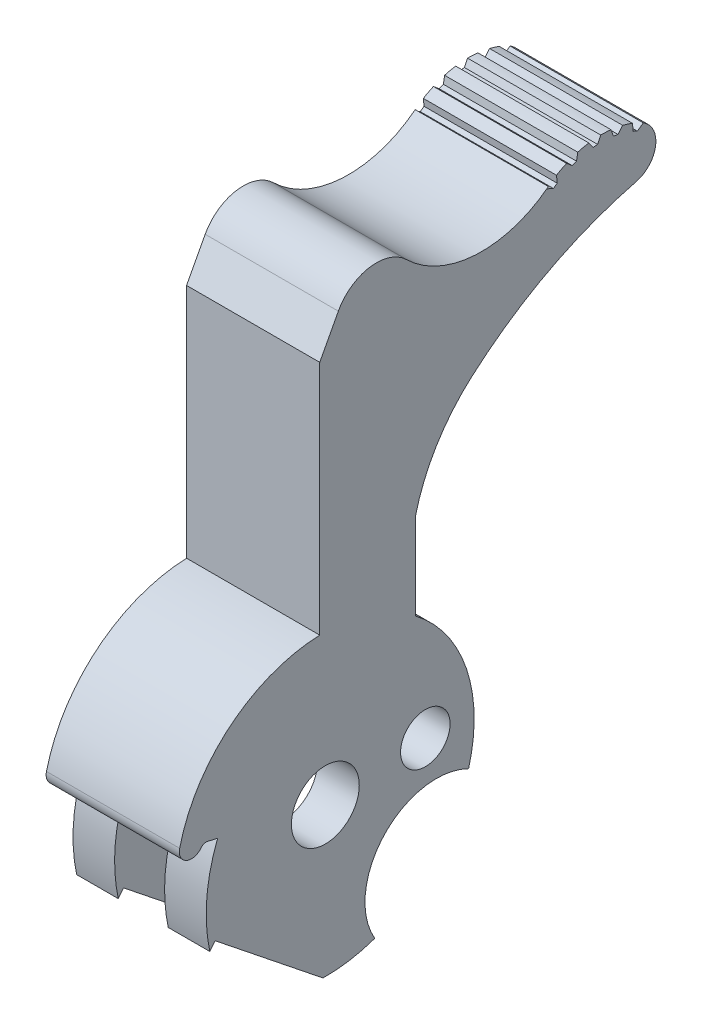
from build123d import *

# Parameters (mm, degrees)
BOSS_EXTRUDE1_DEPTH = 3.9243
SKETCH1_3_R         = 2.00025
SKETCH1_3_R_2       = 1.460154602
CUT_EXTRUDE1_DEPTH  = 3.9243
CUT_EXTRUDE2_START  = -7.8486
CUT_EXTRUDE2_DEPTH  = 7.8486
CUT_EXTRUDE3_DEPTH  = 1.4732


with BuildPart() as part:
    # Sketch1 → Boss-Extrude1 (new, symmetric)
    with BuildSketch(Plane(origin=(0, 0, 0), x_dir=(0, 0, -1), z_dir=(1, 0, 0))):
        with BuildLine():
            Line((-0.3302, 8.826968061), (-0.3302, 22.75164579))
            Line((-0.3302, 22.75164579), (0.766616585, 24.814457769))
            ThreePointArc((0.766616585, 24.814457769), (2.619321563, 26.131883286), (4.784425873, 25.438738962))
            ThreePointArc((4.784425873, 25.438738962), (8.879896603, 23.639820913), (13.145242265, 24.987341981))
            ThreePointArc((13.145242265, 24.987341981), (15.837831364, 26.053146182), (18.675292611, 25.474537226))
            ThreePointArc((18.675292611, 25.474537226), (19.47064603, 23.945954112), (18.331995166, 22.652653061))
            ThreePointArc((18.331995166, 22.652653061), (13.166970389, 20.668693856), (8.613175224, 17.526))
            ThreePointArc((8.613175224, 17.526), (6.543107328, 15.049229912), (5.3086, 12.066686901))
            Line((5.3086, 12.066686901), (5.3086, 6.983313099))
            ThreePointArc((5.3086, 6.983313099), (8.317960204, 2.785576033), (8.443547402, -2.377898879))
            ThreePointArc((8.443547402, -2.377898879), (3.477922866, -3.262237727), (2.912868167, -8.274242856))
            ThreePointArc((2.912868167, -8.274242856), (1.409383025, -8.658032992), (-0.138202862, -8.770906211))
            Line((-0.138202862, -8.770906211), (-6.494134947, -3.692419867))
            Line((-6.494134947, -3.692419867), (-6.807391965, -4.084473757))
            ThreePointArc((-6.807391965, -4.084473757), (-6.990019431, -1.275331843), (-6.347900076, 1.465528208))
            Line((-6.347900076, 1.465528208), (-6.93746292, 1.601639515))
            ThreePointArc((-6.93746292, 1.601639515), (-7.150845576, 1.589374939), (-7.324048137, 1.464141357))
            ThreePointArc((-7.324048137, 1.464141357), (-8.200857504, 1.258047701), (-8.586707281, 2.071920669))
            ThreePointArc((-8.586707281, 2.071920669), (-5.59334204, 6.836587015), (-0.3302, 8.826968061))
        make_face()
    extrude(amount=BOSS_EXTRUDE1_DEPTH, both=True)

    # Sketch1_3 → Cut-Extrude1 (cut, symmetric)
    with BuildSketch(Plane(origin=(0, 0, 0), x_dir=(0, 0, -1), z_dir=(1, 0, 0))):
        Circle(SKETCH1_3_R)
        with Locations((5.8928, 0.4572)):
            Circle(SKETCH1_3_R_2)
    extrude(amount=CUT_EXTRUDE1_DEPTH, both=True, mode=Mode.SUBTRACT)

    # Sketch2 → Cut-Extrude2 (cut)
    with BuildSketch(Plane.ZY.offset(3.9243).offset(CUT_EXTRUDE2_START)):
        with BuildLine():
            Line((-16.231839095, 26.072482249), (-16.047783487, 25.685823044))
            ThreePointArc((-16.047783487, 25.685823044), (-15.911304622, 25.676971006), (-15.775141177, 25.664150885))
            Line((-15.775141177, 25.664150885), (-15.532312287, 26.01687732))
            ThreePointArc((-15.532312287, 26.01687732), (-15.88111441, 26.056772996), (-16.231839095, 26.072482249))
        make_face()
        with BuildLine():
            Line((-14.87779335, 25.874341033), (-14.803626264, 25.452581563))
            ThreePointArc((-14.803626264, 25.452581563), (-14.674462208, 25.407620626), (-14.546661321, 25.358919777))
            Line((-14.546661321, 25.358919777), (-14.218490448, 25.634030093))
            ThreePointArc((-14.218490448, 25.634030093), (-14.543987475, 25.765583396), (-14.87779335, 25.874341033))
        make_face()
        with BuildLine():
            Line((-13.625766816, 25.32195586), (-13.666870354, 24.895702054))
            ThreePointArc((-13.666870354, 24.895702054), (-13.554394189, 24.817894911), (-13.444230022, 24.736847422))
            Line((-13.444230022, 24.736847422), (-13.054531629, 24.914377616))
            ThreePointArc((-13.054531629, 24.914377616), (-13.333103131, 25.128042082), (-13.625766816, 25.32195586))
        make_face()
        with BuildLine():
            Line((-17.526605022, 25.918339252), (-17.250187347, 25.591268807))
            ThreePointArc((-17.250187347, 25.591268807), (-17.115950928, 25.617449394), (-16.981009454, 25.63971232))
            Line((-16.981009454, 25.63971232), (-16.835966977, 26.042632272))
            ThreePointArc((-16.835966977, 26.042632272), (-17.18343474, 25.992425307), (-17.526605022, 25.918339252))
        make_face()
        with BuildLine():
            Line((-18.739482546, 25.439688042), (-18.38891377, 25.193754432))
            ThreePointArc((-18.38891377, 25.193754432), (-18.26576357, 25.253242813), (-18.140934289, 25.309122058))
            Line((-18.140934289, 25.309122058), (-18.103233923, 25.735690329))
            ThreePointArc((-18.103233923, 25.735690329), (-18.426475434, 25.598688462), (-18.739482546, 25.439688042))
        make_face()
    extrude(amount=CUT_EXTRUDE2_DEPTH, mode=Mode.SUBTRACT)

    # Sketch4 → Cut-Extrude3 (cut, symmetric)
    with BuildSketch(Plane.ZY):
        Polygon((8.599177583, -10.627614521), (-11.454591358, -7.091593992), (-9.539195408, 3.771156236), (10.514573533, 0.235135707), align=None)
    extrude(amount=CUT_EXTRUDE3_DEPTH, both=True, mode=Mode.SUBTRACT)


solid = part.part
